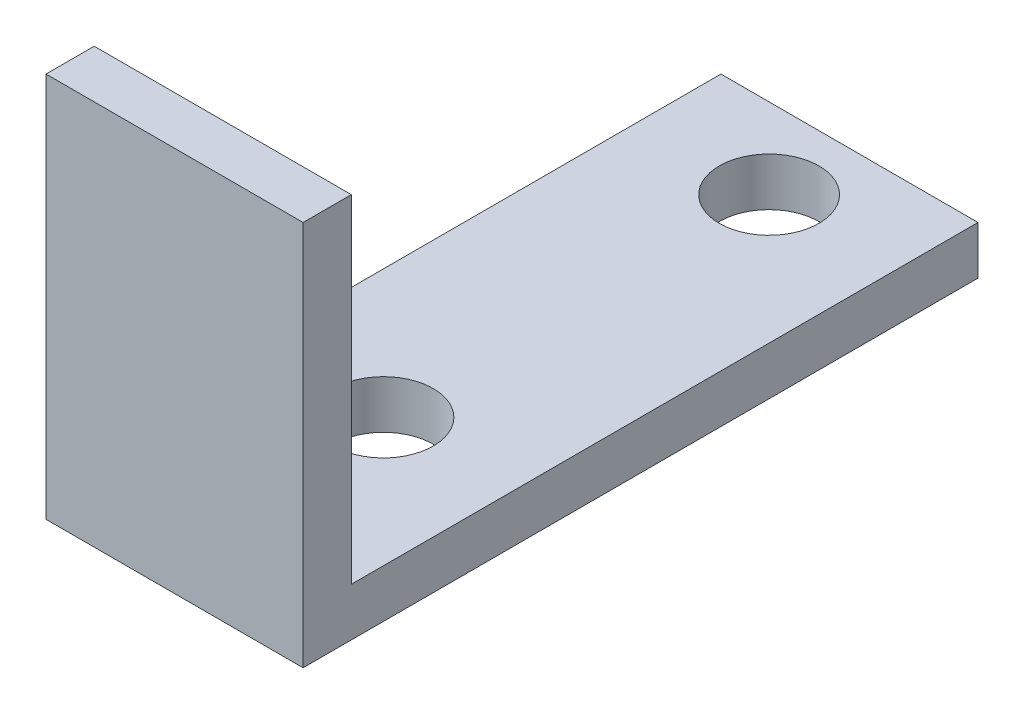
from build123d import *

# Parameters (mm, degrees)
BOSS_EXTRUDE1_DEPTH        = 8
F_3_1_3_1_DIAMETER_HOLE1_D = 3.1


with BuildPart() as part:
    # Sketch1 → Boss-Extrude1 (new body)
    with BuildSketch(Plane(origin=(0, 0, 0), x_dir=(0, 0, -1), z_dir=(1, 0, 0))):
        Polygon((0, 0), (0, 12), (1.5, 12), (1.5, 1.5), (21, 1.5), (21, 0), align=None)
    extrude(amount=BOSS_EXTRUDE1_DEPTH)

    # 3.1 _3.1_ Diameter Hole1 (through all)
    with Locations(Plane(origin=(0, 1.5, 0), x_dir=(1, 0, 0), z_dir=(0, 1, 0))):
        with Locations((4, 18.5), (4, 6.5)):
            Hole(F_3_1_3_1_DIAMETER_HOLE1_D / 2)


solid = part.part
